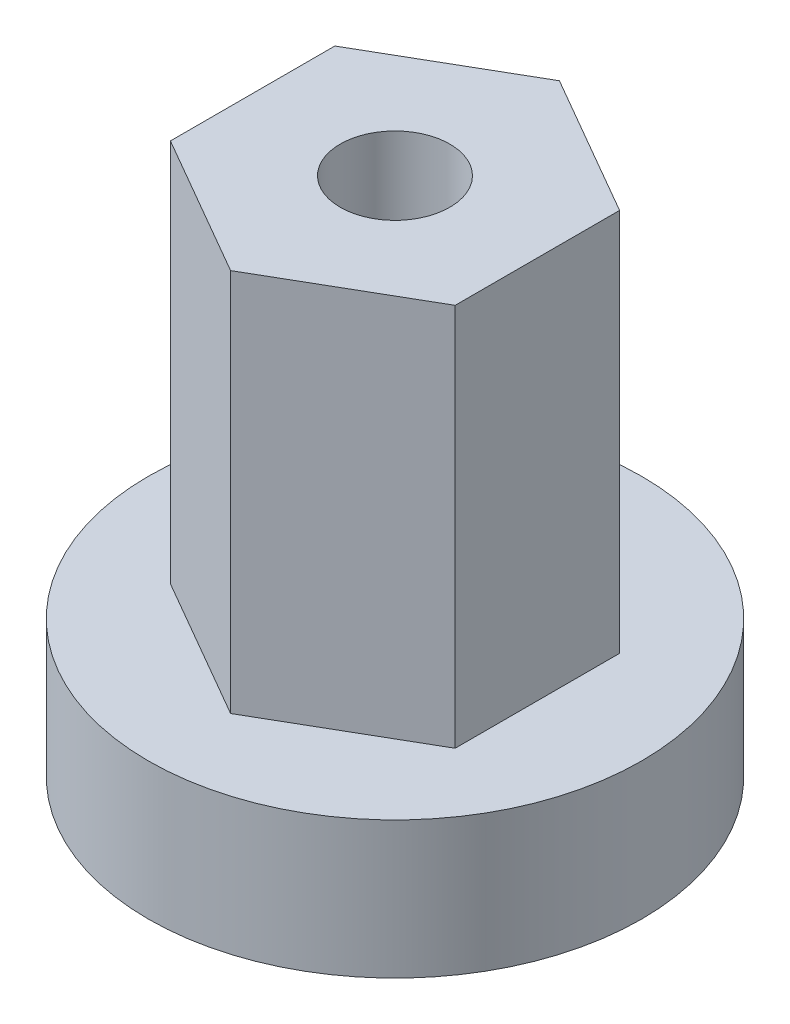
ISO-10303-21;
HEADER;
FILE_DESCRIPTION(('STEP AP214'),'2;1');
FILE_NAME('part.step','',(''),(''),'','','');
FILE_SCHEMA(('AUTOMOTIVE_DESIGN { 1 0 10303 214 1 1 1 1 }'));
ENDSEC;
DATA;
#1=APPLICATION_CONTEXT('core data for automotive mechanical design processes');
#2=APPLICATION_PROTOCOL_DEFINITION('international standard','automotive_design',2000,#1);
#3=PRODUCT_CONTEXT('',#1,'mechanical');
#4=PRODUCT('Part','Part','',(#3));
#5=PRODUCT_RELATED_PRODUCT_CATEGORY('part','',(#4));
#6=PRODUCT_DEFINITION_FORMATION('','',#4);
#7=PRODUCT_DEFINITION_CONTEXT('part definition',#1,'design');
#8=PRODUCT_DEFINITION('design','',#6,#7);
#9=PRODUCT_DEFINITION_SHAPE('','',#8);
#10=(LENGTH_UNIT() NAMED_UNIT(*) SI_UNIT(.MILLI.,.METRE.));
#11=(NAMED_UNIT(*) PLANE_ANGLE_UNIT() SI_UNIT($,.RADIAN.));
#12=(NAMED_UNIT(*) SI_UNIT($,.STERADIAN.) SOLID_ANGLE_UNIT());
#13=UNCERTAINTY_MEASURE_WITH_UNIT(LENGTH_MEASURE(1.E-05),#10,'distance_accuracy_value','');
#14=(GEOMETRIC_REPRESENTATION_CONTEXT(3) GLOBAL_UNCERTAINTY_ASSIGNED_CONTEXT((#13)) GLOBAL_UNIT_ASSIGNED_CONTEXT((#10,
#11,#12)) REPRESENTATION_CONTEXT('',''));
#15=CARTESIAN_POINT('',(0.,0.,0.));
#16=DIRECTION('',(0.,0.,1.));
#17=DIRECTION('',(1.,0.,0.));
#18=AXIS2_PLACEMENT_3D('',#15,#16,#17);
#19=CARTESIAN_POINT('',(0.,10.,0.));
#20=DIRECTION('',(0.,1.,0.));
#21=DIRECTION('',(0.,0.,1.));
#22=AXIS2_PLACEMENT_3D('',#19,#20,#21);
#23=PLANE('',#22);
#24=CARTESIAN_POINT('',(0.,10.,0.));
#25=DIRECTION('',(0.,1.,0.));
#26=DIRECTION('',(0.,0.,1.));
#27=AXIS2_PLACEMENT_3D('',#24,#25,#26);
#28=CIRCLE('',#27,18.);
#29=CARTESIAN_POINT('',(0.,10.,18.));
#30=VERTEX_POINT('',#29);
#31=EDGE_CURVE('E11',#30,#30,#28,.T.);
#32=ORIENTED_EDGE('',*,*,#31,.T.);
#33=EDGE_LOOP('',(#32));
#34=FACE_BOUND('',#33,.T.);
#35=DIRECTION('',(-0.866025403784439,0.,0.5));
#36=VECTOR('',#35,1.);
#37=CARTESIAN_POINT('',(0.,10.,-12.));
#38=LINE('',#37,#36);
#39=CARTESIAN_POINT('',(0.,10.,-12.));
#40=VERTEX_POINT('',#39);
#41=CARTESIAN_POINT('',(-10.3923048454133,10.,-6.));
#42=VERTEX_POINT('',#41);
#43=EDGE_CURVE('E118',#40,#42,#38,.T.);
#44=ORIENTED_EDGE('',*,*,#43,.F.);
#45=DIRECTION('',(-0.866025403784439,0.,-0.5));
#46=VECTOR('',#45,1.);
#47=CARTESIAN_POINT('',(10.3923048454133,10.,-6.00000000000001));
#48=LINE('',#47,#46);
#49=CARTESIAN_POINT('',(10.3923048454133,10.,-6.00000000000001));
#50=VERTEX_POINT('',#49);
#51=EDGE_CURVE('E115',#50,#40,#48,.T.);
#52=ORIENTED_EDGE('',*,*,#51,.F.);
#53=DIRECTION('',(0.,0.,-1.));
#54=VECTOR('',#53,1.);
#55=CARTESIAN_POINT('',(10.3923048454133,10.,6.));
#56=LINE('',#55,#54);
#57=CARTESIAN_POINT('',(10.3923048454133,10.,6.));
#58=VERTEX_POINT('',#57);
#59=EDGE_CURVE('E74',#58,#50,#56,.T.);
#60=ORIENTED_EDGE('',*,*,#59,.F.);
#61=DIRECTION('',(0.866025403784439,0.,-0.5));
#62=VECTOR('',#61,1.);
#63=CARTESIAN_POINT('',(0.,10.,12.));
#64=LINE('',#63,#62);
#65=CARTESIAN_POINT('',(0.,10.,12.));
#66=VERTEX_POINT('',#65);
#67=EDGE_CURVE('E124',#66,#58,#64,.T.);
#68=ORIENTED_EDGE('',*,*,#67,.F.);
#69=DIRECTION('',(0.866025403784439,0.,0.5));
#70=VECTOR('',#69,1.);
#71=CARTESIAN_POINT('',(-10.3923048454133,10.,6.));
#72=LINE('',#71,#70);
#73=CARTESIAN_POINT('',(-10.3923048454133,10.,6.));
#74=VERTEX_POINT('',#73);
#75=EDGE_CURVE('E104',#74,#66,#72,.T.);
#76=ORIENTED_EDGE('',*,*,#75,.F.);
#77=DIRECTION('',(0.,0.,1.));
#78=VECTOR('',#77,1.);
#79=CARTESIAN_POINT('',(-10.3923048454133,10.,-6.));
#80=LINE('',#79,#78);
#81=EDGE_CURVE('E121',#42,#74,#80,.T.);
#82=ORIENTED_EDGE('',*,*,#81,.F.);
#83=EDGE_LOOP('',(#44,#52,#60,#68,#76,#82));
#84=FACE_BOUND('',#83,.T.);
#85=ADVANCED_FACE('F31',(#34,#84),#23,.T.);
#86=CARTESIAN_POINT('',(0.,10.,0.));
#87=DIRECTION('',(0.,-1.,0.));
#88=DIRECTION('',(0.,0.,-1.));
#89=AXIS2_PLACEMENT_3D('',#86,#87,#88);
#90=CYLINDRICAL_SURFACE('',#89,18.);
#91=ORIENTED_EDGE('',*,*,#31,.F.);
#92=EDGE_LOOP('',(#91));
#93=FACE_BOUND('',#92,.T.);
#94=CARTESIAN_POINT('',(0.,0.,0.));
#95=DIRECTION('',(0.,1.,0.));
#96=DIRECTION('',(0.,0.,1.));
#97=AXIS2_PLACEMENT_3D('',#94,#95,#96);
#98=CIRCLE('',#97,18.);
#99=CARTESIAN_POINT('',(0.,0.,18.));
#100=VERTEX_POINT('',#99);
#101=EDGE_CURVE('E35',#100,#100,#98,.T.);
#102=ORIENTED_EDGE('',*,*,#101,.T.);
#103=EDGE_LOOP('',(#102));
#104=FACE_BOUND('',#103,.T.);
#105=ADVANCED_FACE('F33',(#93,#104),#90,.T.);
#106=CARTESIAN_POINT('',(0.,0.,0.));
#107=DIRECTION('',(0.,1.,0.));
#108=DIRECTION('',(0.,0.,1.));
#109=AXIS2_PLACEMENT_3D('',#106,#107,#108);
#110=PLANE('',#109);
#111=CARTESIAN_POINT('',(0.,0.,0.));
#112=DIRECTION('',(0.,1.,0.));
#113=DIRECTION('',(0.,0.,1.));
#114=AXIS2_PLACEMENT_3D('',#111,#112,#113);
#115=CIRCLE('',#114,7.);
#116=CARTESIAN_POINT('',(0.,0.,7.));
#117=VERTEX_POINT('',#116);
#118=EDGE_CURVE('E191',#117,#117,#115,.T.);
#119=ORIENTED_EDGE('',*,*,#118,.T.);
#120=EDGE_LOOP('',(#119));
#121=FACE_BOUND('',#120,.T.);
#122=ORIENTED_EDGE('',*,*,#101,.F.);
#123=EDGE_LOOP('',(#122));
#124=FACE_BOUND('',#123,.T.);
#125=ADVANCED_FACE('F140',(#121,#124),#110,.F.);
#126=CARTESIAN_POINT('',(10.3923048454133,38.,-6.00000000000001));
#127=DIRECTION('',(-0.5,0.,0.866025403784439));
#128=DIRECTION('',(0.866025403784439,0.,0.5));
#129=AXIS2_PLACEMENT_3D('',#126,#127,#128);
#130=PLANE('',#129);
#131=ORIENTED_EDGE('',*,*,#51,.T.);
#132=DIRECTION('',(0.,-1.,0.));
#133=VECTOR('',#132,1.);
#134=CARTESIAN_POINT('',(0.,38.,-12.));
#135=LINE('',#134,#133);
#136=CARTESIAN_POINT('',(0.,38.,-12.));
#137=VERTEX_POINT('',#136);
#138=EDGE_CURVE('E134',#137,#40,#135,.T.);
#139=ORIENTED_EDGE('',*,*,#138,.F.);
#140=DIRECTION('',(-0.866025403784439,0.,-0.5));
#141=VECTOR('',#140,1.);
#142=CARTESIAN_POINT('',(10.3923048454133,38.,-6.00000000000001));
#143=LINE('',#142,#141);
#144=CARTESIAN_POINT('',(10.3923048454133,38.,-6.00000000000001));
#145=VERTEX_POINT('',#144);
#146=EDGE_CURVE('E127',#145,#137,#143,.T.);
#147=ORIENTED_EDGE('',*,*,#146,.F.);
#148=DIRECTION('',(0.,-1.,0.));
#149=VECTOR('',#148,1.);
#150=CARTESIAN_POINT('',(10.3923048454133,38.,-6.00000000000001));
#151=LINE('',#150,#149);
#152=EDGE_CURVE('E111',#145,#50,#151,.T.);
#153=ORIENTED_EDGE('',*,*,#152,.T.);
#154=EDGE_LOOP('',(#131,#139,#147,#153));
#155=FACE_BOUND('',#154,.T.);
#156=ADVANCED_FACE('F142',(#155),#130,.F.);
#157=CARTESIAN_POINT('',(0.,38.,-12.));
#158=DIRECTION('',(0.5,0.,0.866025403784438));
#159=DIRECTION('',(0.866025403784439,0.,-0.5));
#160=AXIS2_PLACEMENT_3D('',#157,#158,#159);
#161=PLANE('',#160);
#162=ORIENTED_EDGE('',*,*,#43,.T.);
#163=DIRECTION('',(0.,-1.,0.));
#164=VECTOR('',#163,1.);
#165=CARTESIAN_POINT('',(-10.3923048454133,38.,-6.));
#166=LINE('',#165,#164);
#167=CARTESIAN_POINT('',(-10.3923048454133,38.,-6.));
#168=VERTEX_POINT('',#167);
#169=EDGE_CURVE('E131',#168,#42,#166,.T.);
#170=ORIENTED_EDGE('',*,*,#169,.F.);
#171=DIRECTION('',(-0.866025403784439,0.,0.5));
#172=VECTOR('',#171,1.);
#173=CARTESIAN_POINT('',(0.,38.,-12.));
#174=LINE('',#173,#172);
#175=EDGE_CURVE('E82',#137,#168,#174,.T.);
#176=ORIENTED_EDGE('',*,*,#175,.F.);
#177=ORIENTED_EDGE('',*,*,#138,.T.);
#178=EDGE_LOOP('',(#162,#170,#176,#177));
#179=FACE_BOUND('',#178,.T.);
#180=ADVANCED_FACE('F148',(#179),#161,.F.);
#181=CARTESIAN_POINT('',(-10.3923048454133,38.,-6.));
#182=DIRECTION('',(1.,0.,0.));
#183=DIRECTION('',(0.,0.,-1.));
#184=AXIS2_PLACEMENT_3D('',#181,#182,#183);
#185=PLANE('',#184);
#186=ORIENTED_EDGE('',*,*,#81,.T.);
#187=DIRECTION('',(0.,-1.,0.));
#188=VECTOR('',#187,1.);
#189=CARTESIAN_POINT('',(-10.3923048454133,38.,6.));
#190=LINE('',#189,#188);
#191=CARTESIAN_POINT('',(-10.3923048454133,38.,6.));
#192=VERTEX_POINT('',#191);
#193=EDGE_CURVE('E107',#192,#74,#190,.T.);
#194=ORIENTED_EDGE('',*,*,#193,.F.);
#195=DIRECTION('',(0.,0.,1.));
#196=VECTOR('',#195,1.);
#197=CARTESIAN_POINT('',(-10.3923048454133,38.,-6.));
#198=LINE('',#197,#196);
#199=EDGE_CURVE('E95',#168,#192,#198,.T.);
#200=ORIENTED_EDGE('',*,*,#199,.F.);
#201=ORIENTED_EDGE('',*,*,#169,.T.);
#202=EDGE_LOOP('',(#186,#194,#200,#201));
#203=FACE_BOUND('',#202,.T.);
#204=ADVANCED_FACE('F162',(#203),#185,.F.);
#205=CARTESIAN_POINT('',(-10.3923048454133,38.,6.));
#206=DIRECTION('',(0.5,0.,-0.866025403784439));
#207=DIRECTION('',(-0.866025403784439,0.,-0.5));
#208=AXIS2_PLACEMENT_3D('',#205,#206,#207);
#209=PLANE('',#208);
#210=ORIENTED_EDGE('',*,*,#75,.T.);
#211=DIRECTION('',(0.,-1.,0.));
#212=VECTOR('',#211,1.);
#213=CARTESIAN_POINT('',(0.,38.,12.));
#214=LINE('',#213,#212);
#215=CARTESIAN_POINT('',(0.,38.,12.));
#216=VERTEX_POINT('',#215);
#217=EDGE_CURVE('E101',#216,#66,#214,.T.);
#218=ORIENTED_EDGE('',*,*,#217,.F.);
#219=DIRECTION('',(0.866025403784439,0.,0.5));
#220=VECTOR('',#219,1.);
#221=CARTESIAN_POINT('',(-10.3923048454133,38.,6.));
#222=LINE('',#221,#220);
#223=EDGE_CURVE('E89',#192,#216,#222,.T.);
#224=ORIENTED_EDGE('',*,*,#223,.F.);
#225=ORIENTED_EDGE('',*,*,#193,.T.);
#226=EDGE_LOOP('',(#210,#218,#224,#225));
#227=FACE_BOUND('',#226,.T.);
#228=ADVANCED_FACE('F102',(#227),#209,.F.);
#229=CARTESIAN_POINT('',(0.,38.,12.));
#230=DIRECTION('',(-0.5,0.,-0.866025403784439));
#231=DIRECTION('',(-0.866025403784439,0.,0.5));
#232=AXIS2_PLACEMENT_3D('',#229,#230,#231);
#233=PLANE('',#232);
#234=ORIENTED_EDGE('',*,*,#67,.T.);
#235=DIRECTION('',(0.,-1.,0.));
#236=VECTOR('',#235,1.);
#237=CARTESIAN_POINT('',(10.3923048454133,38.,6.));
#238=LINE('',#237,#236);
#239=CARTESIAN_POINT('',(10.3923048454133,38.,6.));
#240=VERTEX_POINT('',#239);
#241=EDGE_CURVE('E46',#240,#58,#238,.T.);
#242=ORIENTED_EDGE('',*,*,#241,.F.);
#243=DIRECTION('',(0.866025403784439,0.,-0.5));
#244=VECTOR('',#243,1.);
#245=CARTESIAN_POINT('',(0.,38.,12.));
#246=LINE('',#245,#244);
#247=EDGE_CURVE('E93',#216,#240,#246,.T.);
#248=ORIENTED_EDGE('',*,*,#247,.F.);
#249=ORIENTED_EDGE('',*,*,#217,.T.);
#250=EDGE_LOOP('',(#234,#242,#248,#249));
#251=FACE_BOUND('',#250,.T.);
#252=ADVANCED_FACE('F109',(#251),#233,.F.);
#253=CARTESIAN_POINT('',(10.3923048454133,38.,6.));
#254=DIRECTION('',(-1.,0.,0.));
#255=DIRECTION('',(0.,0.,1.));
#256=AXIS2_PLACEMENT_3D('',#253,#254,#255);
#257=PLANE('',#256);
#258=ORIENTED_EDGE('',*,*,#59,.T.);
#259=ORIENTED_EDGE('',*,*,#152,.F.);
#260=DIRECTION('',(0.,0.,-1.));
#261=VECTOR('',#260,1.);
#262=CARTESIAN_POINT('',(10.3923048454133,38.,6.));
#263=LINE('',#262,#261);
#264=EDGE_CURVE('E54',#240,#145,#263,.T.);
#265=ORIENTED_EDGE('',*,*,#264,.F.);
#266=ORIENTED_EDGE('',*,*,#241,.T.);
#267=EDGE_LOOP('',(#258,#259,#265,#266));
#268=FACE_BOUND('',#267,.T.);
#269=ADVANCED_FACE('F170',(#268),#257,.F.);
#270=CARTESIAN_POINT('',(0.,38.,-12.));
#271=DIRECTION('',(0.,1.,0.));
#272=DIRECTION('',(0.,0.,1.));
#273=AXIS2_PLACEMENT_3D('',#270,#271,#272);
#274=PLANE('',#273);
#275=CARTESIAN_POINT('',(0.,38.,0.));
#276=DIRECTION('',(0.,1.,0.));
#277=DIRECTION('',(0.,0.,1.));
#278=AXIS2_PLACEMENT_3D('',#275,#276,#277);
#279=CIRCLE('',#278,4.);
#280=CARTESIAN_POINT('',(0.,38.,4.));
#281=VERTEX_POINT('',#280);
#282=EDGE_CURVE('E119',#281,#281,#279,.T.);
#283=ORIENTED_EDGE('',*,*,#282,.F.);
#284=EDGE_LOOP('',(#283));
#285=FACE_BOUND('',#284,.T.);
#286=ORIENTED_EDGE('',*,*,#146,.T.);
#287=ORIENTED_EDGE('',*,*,#175,.T.);
#288=ORIENTED_EDGE('',*,*,#199,.T.);
#289=ORIENTED_EDGE('',*,*,#223,.T.);
#290=ORIENTED_EDGE('',*,*,#247,.T.);
#291=ORIENTED_EDGE('',*,*,#264,.T.);
#292=EDGE_LOOP('',(#286,#287,#288,#289,#290,#291));
#293=FACE_BOUND('',#292,.T.);
#294=ADVANCED_FACE('F91',(#285,#293),#274,.T.);
#295=CARTESIAN_POINT('',(0.,39.010629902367,0.));
#296=DIRECTION('',(0.,1.,0.));
#297=DIRECTION('',(0.,0.,1.));
#298=AXIS2_PLACEMENT_3D('',#295,#296,#297);
#299=CYLINDRICAL_SURFACE('',#298,4.);
#300=CARTESIAN_POINT('',(0.,22.,0.));
#301=DIRECTION('',(0.,1.,0.));
#302=DIRECTION('',(0.,0.,1.));
#303=AXIS2_PLACEMENT_3D('',#300,#301,#302);
#304=CIRCLE('',#303,4.);
#305=CARTESIAN_POINT('',(0.,22.,4.));
#306=VERTEX_POINT('',#305);
#307=EDGE_CURVE('E195',#306,#306,#304,.T.);
#308=ORIENTED_EDGE('',*,*,#307,.F.);
#309=EDGE_LOOP('',(#308));
#310=FACE_BOUND('',#309,.T.);
#311=ORIENTED_EDGE('',*,*,#282,.T.);
#312=EDGE_LOOP('',(#311));
#313=FACE_BOUND('',#312,.T.);
#314=ADVANCED_FACE('F175',(#310,#313),#299,.F.);
#315=CARTESIAN_POINT('',(-4.,22.,0.));
#316=DIRECTION('',(0.,1.,0.));
#317=DIRECTION('',(0.,0.,1.));
#318=AXIS2_PLACEMENT_3D('',#315,#316,#317);
#319=PLANE('',#318);
#320=CARTESIAN_POINT('',(0.,22.,0.));
#321=DIRECTION('',(0.,1.,0.));
#322=DIRECTION('',(0.,0.,1.));
#323=AXIS2_PLACEMENT_3D('',#320,#321,#322);
#324=CIRCLE('',#323,7.);
#325=CARTESIAN_POINT('',(0.,22.,7.));
#326=VERTEX_POINT('',#325);
#327=EDGE_CURVE('E194',#326,#326,#324,.T.);
#328=ORIENTED_EDGE('',*,*,#327,.F.);
#329=EDGE_LOOP('',(#328));
#330=FACE_BOUND('',#329,.T.);
#331=ORIENTED_EDGE('',*,*,#307,.T.);
#332=EDGE_LOOP('',(#331));
#333=FACE_BOUND('',#332,.T.);
#334=ADVANCED_FACE('F179',(#330,#333),#319,.F.);
#335=CARTESIAN_POINT('',(0.,39.010629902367,0.));
#336=DIRECTION('',(0.,1.,0.));
#337=DIRECTION('',(0.,0.,1.));
#338=AXIS2_PLACEMENT_3D('',#335,#336,#337);
#339=CYLINDRICAL_SURFACE('',#338,7.);
#340=ORIENTED_EDGE('',*,*,#118,.F.);
#341=EDGE_LOOP('',(#340));
#342=FACE_BOUND('',#341,.T.);
#343=ORIENTED_EDGE('',*,*,#327,.T.);
#344=EDGE_LOOP('',(#343));
#345=FACE_BOUND('',#344,.T.);
#346=ADVANCED_FACE('F183',(#342,#345),#339,.F.);
#347=CLOSED_SHELL('',(#85,#105,#125,#156,#180,#204,#228,#252,#269,#294,#314,#334,#346));
#348=MANIFOLD_SOLID_BREP('B2',#347);
#349=ADVANCED_BREP_SHAPE_REPRESENTATION('',(#18,#348),#14);
#350=SHAPE_DEFINITION_REPRESENTATION(#9,#349);
ENDSEC;
END-ISO-10303-21;
